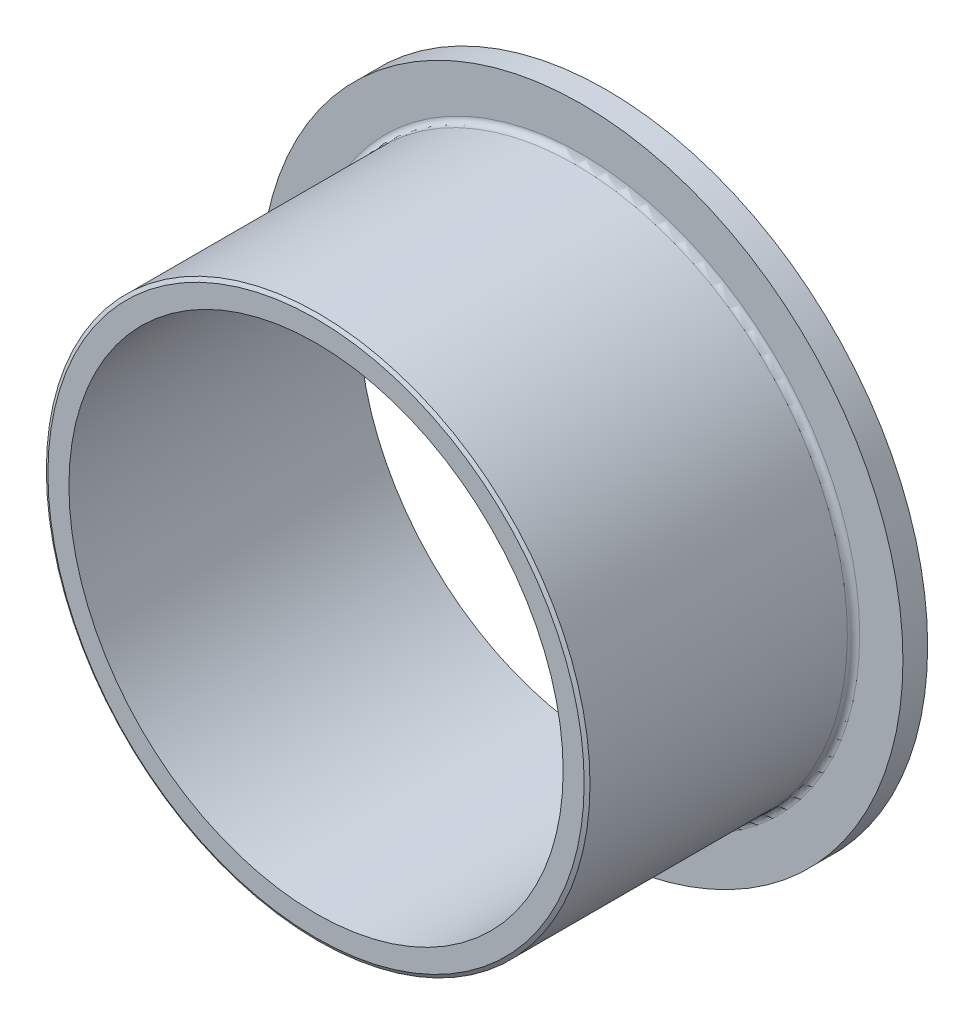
ISO-10303-21;
HEADER;
FILE_DESCRIPTION(('STEP AP214'),'2;1');
FILE_NAME('part.step','',(''),(''),'','','');
FILE_SCHEMA(('AUTOMOTIVE_DESIGN { 1 0 10303 214 1 1 1 1 }'));
ENDSEC;
DATA;
#1=APPLICATION_CONTEXT('core data for automotive mechanical design processes');
#2=APPLICATION_PROTOCOL_DEFINITION('international standard','automotive_design',2000,#1);
#3=PRODUCT_CONTEXT('',#1,'mechanical');
#4=PRODUCT('Part','Part','',(#3));
#5=PRODUCT_RELATED_PRODUCT_CATEGORY('part','',(#4));
#6=PRODUCT_DEFINITION_FORMATION('','',#4);
#7=PRODUCT_DEFINITION_CONTEXT('part definition',#1,'design');
#8=PRODUCT_DEFINITION('design','',#6,#7);
#9=PRODUCT_DEFINITION_SHAPE('','',#8);
#10=(LENGTH_UNIT() NAMED_UNIT(*) SI_UNIT(.MILLI.,.METRE.));
#11=(NAMED_UNIT(*) PLANE_ANGLE_UNIT() SI_UNIT($,.RADIAN.));
#12=(NAMED_UNIT(*) SI_UNIT($,.STERADIAN.) SOLID_ANGLE_UNIT());
#13=UNCERTAINTY_MEASURE_WITH_UNIT(LENGTH_MEASURE(1.E-05),#10,'distance_accuracy_value','');
#14=(GEOMETRIC_REPRESENTATION_CONTEXT(3) GLOBAL_UNCERTAINTY_ASSIGNED_CONTEXT((#13)) GLOBAL_UNIT_ASSIGNED_CONTEXT((#10,
#11,#12)) REPRESENTATION_CONTEXT('',''));
#15=CARTESIAN_POINT('',(0.,0.,0.));
#16=DIRECTION('',(0.,0.,1.));
#17=DIRECTION('',(1.,0.,0.));
#18=AXIS2_PLACEMENT_3D('',#15,#16,#17);
#19=CARTESIAN_POINT('',(0.,0.,30.));
#20=DIRECTION('',(0.,0.,-1.));
#21=DIRECTION('',(-1.,0.,0.));
#22=AXIS2_PLACEMENT_3D('',#19,#20,#21);
#23=CYLINDRICAL_SURFACE('',#22,26.);
#24=CARTESIAN_POINT('',(0.,0.,0.));
#25=DIRECTION('',(0.,0.,1.));
#26=DIRECTION('',(1.,0.,0.));
#27=AXIS2_PLACEMENT_3D('',#24,#25,#26);
#28=CIRCLE('',#27,26.);
#29=CARTESIAN_POINT('',(26.,0.,0.));
#30=VERTEX_POINT('',#29);
#31=EDGE_CURVE('E365',#30,#30,#28,.T.);
#32=ORIENTED_EDGE('',*,*,#31,.T.);
#33=EDGE_LOOP('',(#32));
#34=FACE_BOUND('',#33,.T.);
#35=CARTESIAN_POINT('',(0.,0.,1.99999999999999));
#36=DIRECTION('',(0.,0.,1.));
#37=DIRECTION('',(1.,0.,0.));
#38=AXIS2_PLACEMENT_3D('',#35,#36,#37);
#39=CIRCLE('',#38,26.);
#40=CARTESIAN_POINT('',(26.,0.,1.99999999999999));
#41=VERTEX_POINT('',#40);
#42=EDGE_CURVE('E371',#41,#41,#39,.T.);
#43=ORIENTED_EDGE('',*,*,#42,.F.);
#44=EDGE_LOOP('',(#43));
#45=FACE_BOUND('',#44,.T.);
#46=ADVANCED_FACE('F346',(#34,#45),#23,.T.);
#47=CARTESIAN_POINT('',(0.,0.,0.));
#48=DIRECTION('',(0.,0.,1.));
#49=DIRECTION('',(1.,0.,0.));
#50=AXIS2_PLACEMENT_3D('',#47,#48,#49);
#51=PLANE('',#50);
#52=ORIENTED_EDGE('',*,*,#31,.F.);
#53=EDGE_LOOP('',(#52));
#54=FACE_BOUND('',#53,.T.);
#55=CARTESIAN_POINT('',(0.,0.,0.));
#56=DIRECTION('',(0.,0.,1.));
#57=DIRECTION('',(1.,0.,0.));
#58=AXIS2_PLACEMENT_3D('',#55,#56,#57);
#59=CIRCLE('',#58,20.);
#60=CARTESIAN_POINT('',(20.,0.,0.));
#61=VERTEX_POINT('',#60);
#62=EDGE_CURVE('E368',#61,#61,#59,.T.);
#63=ORIENTED_EDGE('',*,*,#62,.T.);
#64=EDGE_LOOP('',(#63));
#65=FACE_BOUND('',#64,.T.);
#66=ADVANCED_FACE('F384',(#54,#65),#51,.F.);
#67=CARTESIAN_POINT('',(0.,0.,30.));
#68=DIRECTION('',(0.,0.,-1.));
#69=DIRECTION('',(-1.,0.,0.));
#70=AXIS2_PLACEMENT_3D('',#67,#68,#69);
#71=CYLINDRICAL_SURFACE('',#70,20.);
#72=CARTESIAN_POINT('',(0.,0.,23.5));
#73=DIRECTION('',(0.,0.,-1.));
#74=DIRECTION('',(-1.,0.,0.));
#75=AXIS2_PLACEMENT_3D('',#72,#73,#74);
#76=CIRCLE('',#75,20.);
#77=CARTESIAN_POINT('',(-20.,0.,23.5));
#78=VERTEX_POINT('',#77);
#79=EDGE_CURVE('E374',#78,#78,#76,.T.);
#80=ORIENTED_EDGE('',*,*,#79,.F.);
#81=EDGE_LOOP('',(#80));
#82=FACE_BOUND('',#81,.T.);
#83=ORIENTED_EDGE('',*,*,#62,.F.);
#84=EDGE_LOOP('',(#83));
#85=FACE_BOUND('',#84,.T.);
#86=ADVANCED_FACE('F380',(#82,#85),#71,.F.);
#87=CARTESIAN_POINT('',(0.,0.,1.99999999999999));
#88=DIRECTION('',(0.,0.,1.));
#89=DIRECTION('',(1.,0.,0.));
#90=AXIS2_PLACEMENT_3D('',#87,#88,#89);
#91=PLANE('',#90);
#92=CARTESIAN_POINT('',(0.,0.,1.99999999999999));
#93=DIRECTION('',(0.,0.,1.));
#94=DIRECTION('',(1.,0.,0.));
#95=AXIS2_PLACEMENT_3D('',#92,#93,#94);
#96=CIRCLE('',#95,22.5);
#97=CARTESIAN_POINT('',(22.5,0.,1.99999999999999));
#98=VERTEX_POINT('',#97);
#99=EDGE_CURVE('E356',#98,#98,#96,.F.);
#100=ORIENTED_EDGE('',*,*,#99,.T.);
#101=EDGE_LOOP('',(#100));
#102=FACE_BOUND('',#101,.T.);
#103=ORIENTED_EDGE('',*,*,#42,.T.);
#104=EDGE_LOOP('',(#103));
#105=FACE_BOUND('',#104,.T.);
#106=ADVANCED_FACE('F383',(#102,#105),#91,.T.);
#107=CARTESIAN_POINT('',(0.,0.,1.99999999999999));
#108=DIRECTION('',(0.,0.,1.));
#109=DIRECTION('',(1.,0.,0.));
#110=AXIS2_PLACEMENT_3D('',#107,#108,#109);
#111=CYLINDRICAL_SURFACE('',#110,22.);
#112=CARTESIAN_POINT('',(0.,0.,23.3267949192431));
#113=DIRECTION('',(0.,0.,-1.));
#114=DIRECTION('',(-1.,0.,0.));
#115=AXIS2_PLACEMENT_3D('',#112,#113,#114);
#116=CIRCLE('',#115,22.);
#117=CARTESIAN_POINT('',(-22.,0.,23.3267949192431));
#118=VERTEX_POINT('',#117);
#119=EDGE_CURVE('E352',#118,#118,#116,.T.);
#120=ORIENTED_EDGE('',*,*,#119,.T.);
#121=EDGE_LOOP('',(#120));
#122=FACE_BOUND('',#121,.T.);
#123=CARTESIAN_POINT('',(0.,0.,2.5));
#124=DIRECTION('',(0.,0.,1.));
#125=DIRECTION('',(1.,0.,0.));
#126=AXIS2_PLACEMENT_3D('',#123,#124,#125);
#127=CIRCLE('',#126,22.);
#128=CARTESIAN_POINT('',(22.,0.,2.5));
#129=VERTEX_POINT('',#128);
#130=EDGE_CURVE('E360',#129,#129,#127,.T.);
#131=ORIENTED_EDGE('',*,*,#130,.T.);
#132=EDGE_LOOP('',(#131));
#133=FACE_BOUND('',#132,.T.);
#134=ADVANCED_FACE('F399',(#122,#133),#111,.T.);
#135=CARTESIAN_POINT('',(0.,0.,2.5));
#136=DIRECTION('',(0.,0.,1.));
#137=DIRECTION('',(1.,0.,0.));
#138=AXIS2_PLACEMENT_3D('',#135,#136,#137);
#139=TOROIDAL_SURFACE('',#138,22.5,0.5);
#140=ORIENTED_EDGE('',*,*,#99,.F.);
#141=EDGE_LOOP('',(#140));
#142=FACE_BOUND('',#141,.T.);
#143=ORIENTED_EDGE('',*,*,#130,.F.);
#144=EDGE_LOOP('',(#143));
#145=FACE_BOUND('',#144,.T.);
#146=ADVANCED_FACE('F403',(#142,#145),#139,.F.);
#147=CARTESIAN_POINT('',(0.,0.,23.5));
#148=DIRECTION('',(0.,0.,-1.));
#149=DIRECTION('',(-1.,0.,0.));
#150=AXIS2_PLACEMENT_3D('',#147,#148,#149);
#151=PLANE('',#150);
#152=CARTESIAN_POINT('',(0.,0.,23.5));
#153=DIRECTION('',(0.,0.,-1.));
#154=DIRECTION('',(-1.,0.,0.));
#155=AXIS2_PLACEMENT_3D('',#152,#153,#154);
#156=CIRCLE('',#155,21.7);
#157=CARTESIAN_POINT('',(-21.7,0.,23.5));
#158=VERTEX_POINT('',#157);
#159=EDGE_CURVE('E10',#158,#158,#156,.F.);
#160=ORIENTED_EDGE('',*,*,#159,.T.);
#161=EDGE_LOOP('',(#160));
#162=FACE_BOUND('',#161,.T.);
#163=ORIENTED_EDGE('',*,*,#79,.T.);
#164=EDGE_LOOP('',(#163));
#165=FACE_BOUND('',#164,.T.);
#166=ADVANCED_FACE('F378',(#162,#165),#151,.F.);
#167=CARTESIAN_POINT('',(0.,0.,23.3267949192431));
#168=DIRECTION('',(0.,0.,-1.));
#169=DIRECTION('',(-1.,0.,0.));
#170=AXIS2_PLACEMENT_3D('',#167,#168,#169);
#171=CONICAL_SURFACE('',#170,22.,1.04719755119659);
#172=ORIENTED_EDGE('',*,*,#159,.F.);
#173=EDGE_LOOP('',(#172));
#174=FACE_BOUND('',#173,.T.);
#175=ORIENTED_EDGE('',*,*,#119,.F.);
#176=EDGE_LOOP('',(#175));
#177=FACE_BOUND('',#176,.T.);
#178=ADVANCED_FACE('F409',(#174,#177),#171,.T.);
#179=CLOSED_SHELL('',(#46,#66,#86,#106,#134,#146,#166,#178));
#180=MANIFOLD_SOLID_BREP('B2',#179);
#181=ADVANCED_BREP_SHAPE_REPRESENTATION('',(#18,#180),#14);
#182=SHAPE_DEFINITION_REPRESENTATION(#9,#181);
ENDSEC;
END-ISO-10303-21;
